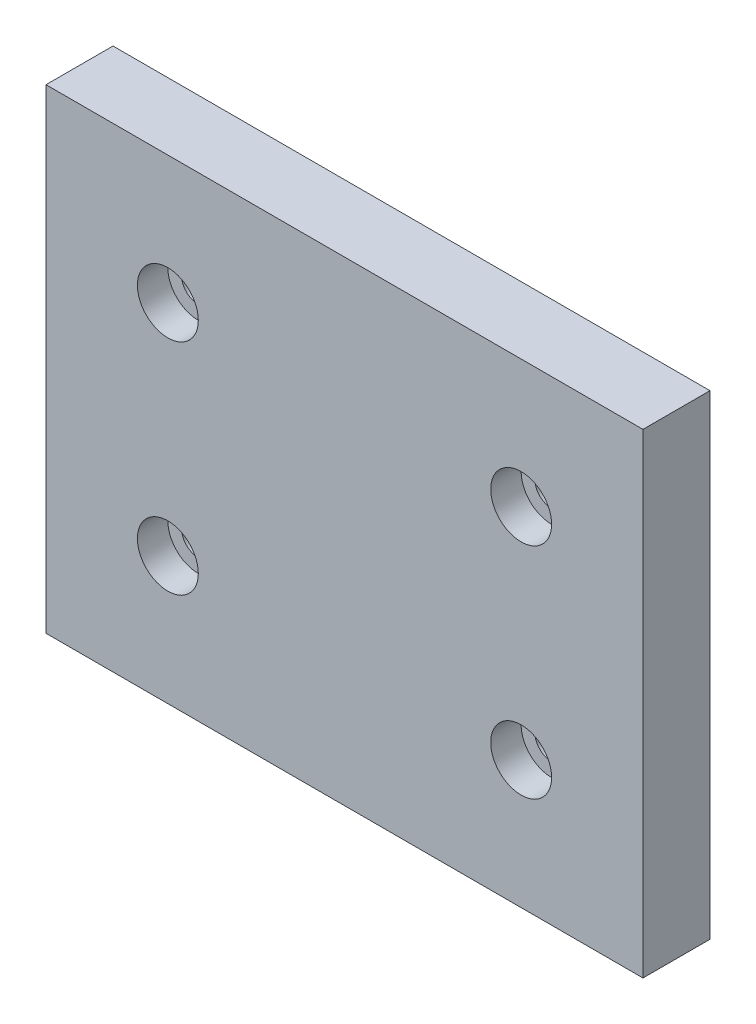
from build123d import *

# Parameters (mm, degrees)
ESQUISSE1_W                                     = 98
ESQUISSE1_H                                     = 78
EXTRUSION1_DEPTH                                = 11
CHAMBRAGE_POUR_VIS_T_TE_CYLINDRIQUE_D           = 5.5
CHAMBRAGE_POUR_VIS_T_TE_CYLINDRIQUE_CBORE_D     = 10
CHAMBRAGE_POUR_VIS_T_TE_CYLINDRIQUE_CBORE_DEPTH = 5


with BuildPart() as part:
    # Esquisse1 → Extrusion1 (new body)
    with BuildSketch(Plane.XY):
        Rectangle(ESQUISSE1_W, ESQUISSE1_H)
    extrude(amount=EXTRUSION1_DEPTH)

    # Chambrage pour vis _ t_te cylindrique (through all)
    with Locations(Plane.XY.offset(11)):
        with Locations((-29, 18), (29, 18), (29, -18), (-29, -18)):
            CounterBoreHole(CHAMBRAGE_POUR_VIS_T_TE_CYLINDRIQUE_D / 2, CHAMBRAGE_POUR_VIS_T_TE_CYLINDRIQUE_CBORE_D / 2, CHAMBRAGE_POUR_VIS_T_TE_CYLINDRIQUE_CBORE_DEPTH)


solid = part.part
